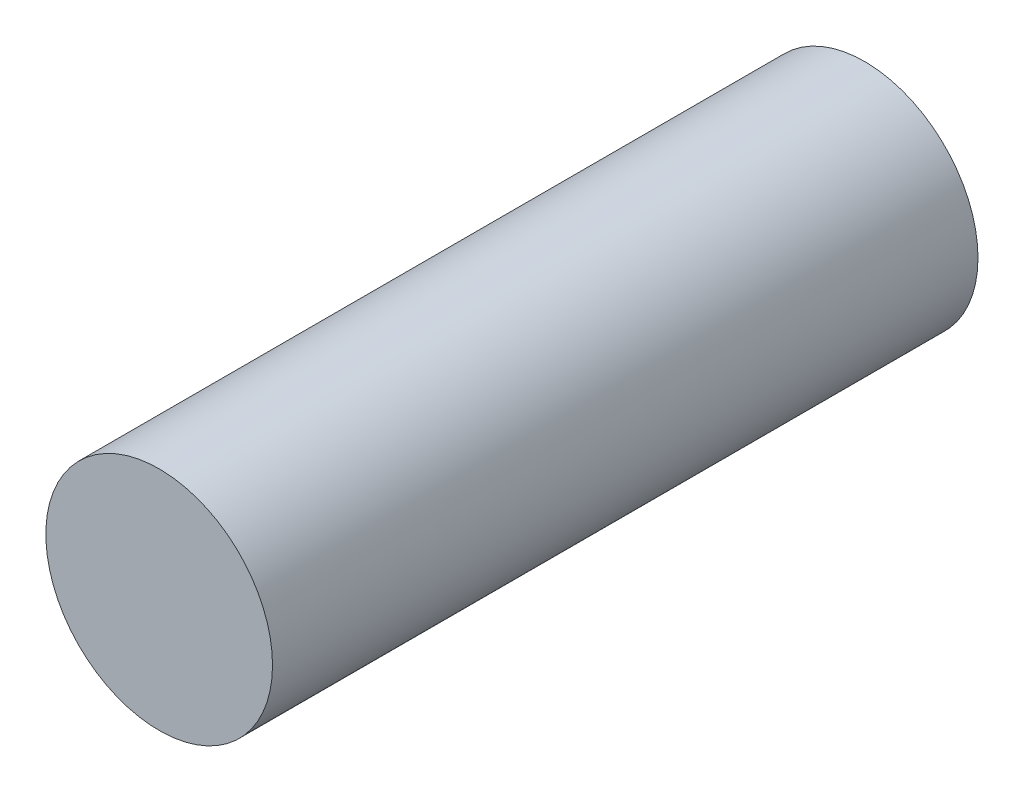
ISO-10303-21;
HEADER;
FILE_DESCRIPTION(('STEP AP214'),'2;1');
FILE_NAME('part.step','',(''),(''),'','','');
FILE_SCHEMA(('AUTOMOTIVE_DESIGN { 1 0 10303 214 1 1 1 1 }'));
ENDSEC;
DATA;
#1=APPLICATION_CONTEXT('core data for automotive mechanical design processes');
#2=APPLICATION_PROTOCOL_DEFINITION('international standard','automotive_design',2000,#1);
#3=PRODUCT_CONTEXT('',#1,'mechanical');
#4=PRODUCT('Part','Part','',(#3));
#5=PRODUCT_RELATED_PRODUCT_CATEGORY('part','',(#4));
#6=PRODUCT_DEFINITION_FORMATION('','',#4);
#7=PRODUCT_DEFINITION_CONTEXT('part definition',#1,'design');
#8=PRODUCT_DEFINITION('design','',#6,#7);
#9=PRODUCT_DEFINITION_SHAPE('','',#8);
#10=(LENGTH_UNIT() NAMED_UNIT(*) SI_UNIT(.MILLI.,.METRE.));
#11=(NAMED_UNIT(*) PLANE_ANGLE_UNIT() SI_UNIT($,.RADIAN.));
#12=(NAMED_UNIT(*) SI_UNIT($,.STERADIAN.) SOLID_ANGLE_UNIT());
#13=UNCERTAINTY_MEASURE_WITH_UNIT(LENGTH_MEASURE(1.E-05),#10,'distance_accuracy_value','');
#14=(GEOMETRIC_REPRESENTATION_CONTEXT(3) GLOBAL_UNCERTAINTY_ASSIGNED_CONTEXT((#13)) GLOBAL_UNIT_ASSIGNED_CONTEXT((#10,
#11,#12)) REPRESENTATION_CONTEXT('',''));
#15=CARTESIAN_POINT('',(0.,0.,0.));
#16=DIRECTION('',(0.,0.,1.));
#17=DIRECTION('',(1.,0.,0.));
#18=AXIS2_PLACEMENT_3D('',#15,#16,#17);
#19=CARTESIAN_POINT('',(0.,0.,0.));
#20=DIRECTION('',(0.,0.,-1.));
#21=DIRECTION('',(-1.,0.,0.));
#22=AXIS2_PLACEMENT_3D('',#19,#20,#21);
#23=PLANE('',#22);
#24=CARTESIAN_POINT('',(0.,0.,0.));
#25=DIRECTION('',(0.,0.,1.));
#26=DIRECTION('',(1.,0.,0.));
#27=AXIS2_PLACEMENT_3D('',#24,#25,#26);
#28=CIRCLE('',#27,44.5);
#29=CARTESIAN_POINT('',(44.5,0.,0.));
#30=VERTEX_POINT('',#29);
#31=EDGE_CURVE('E10',#30,#30,#28,.T.);
#32=ORIENTED_EDGE('',*,*,#31,.T.);
#33=EDGE_LOOP('',(#32));
#34=FACE_BOUND('',#33,.T.);
#35=ADVANCED_FACE('F31',(#34),#23,.F.);
#36=CARTESIAN_POINT('',(0.,0.,0.));
#37=DIRECTION('',(0.,0.,1.));
#38=DIRECTION('',(1.,0.,0.));
#39=AXIS2_PLACEMENT_3D('',#36,#37,#38);
#40=CYLINDRICAL_SURFACE('',#39,44.5);
#41=ORIENTED_EDGE('',*,*,#31,.F.);
#42=EDGE_LOOP('',(#41));
#43=FACE_BOUND('',#42,.T.);
#44=CARTESIAN_POINT('',(0.,0.,-277.));
#45=DIRECTION('',(0.,0.,1.));
#46=DIRECTION('',(1.,0.,0.));
#47=AXIS2_PLACEMENT_3D('',#44,#45,#46);
#48=CIRCLE('',#47,44.5);
#49=CARTESIAN_POINT('',(44.5,0.,-277.));
#50=VERTEX_POINT('',#49);
#51=EDGE_CURVE('E37',#50,#50,#48,.T.);
#52=ORIENTED_EDGE('',*,*,#51,.T.);
#53=EDGE_LOOP('',(#52));
#54=FACE_BOUND('',#53,.T.);
#55=ADVANCED_FACE('F43',(#43,#54),#40,.T.);
#56=CARTESIAN_POINT('',(0.,0.,-277.));
#57=DIRECTION('',(0.,0.,1.));
#58=DIRECTION('',(1.,0.,0.));
#59=AXIS2_PLACEMENT_3D('',#56,#57,#58);
#60=PLANE('',#59);
#61=ORIENTED_EDGE('',*,*,#51,.F.);
#62=EDGE_LOOP('',(#61));
#63=FACE_BOUND('',#62,.T.);
#64=ADVANCED_FACE('F45',(#63),#60,.F.);
#65=CLOSED_SHELL('',(#35,#55,#64));
#66=MANIFOLD_SOLID_BREP('B2',#65);
#67=ADVANCED_BREP_SHAPE_REPRESENTATION('',(#18,#66),#14);
#68=SHAPE_DEFINITION_REPRESENTATION(#9,#67);
ENDSEC;
END-ISO-10303-21;
